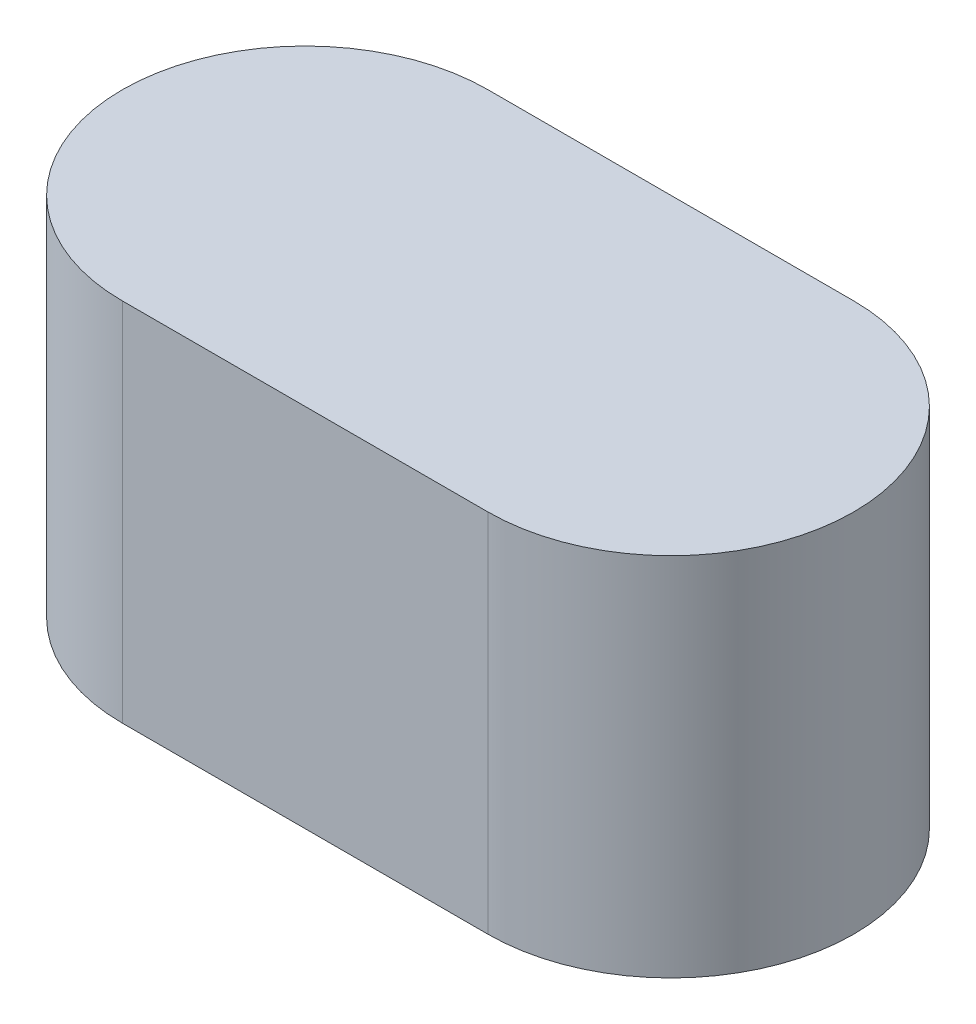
ISO-10303-21;
HEADER;
FILE_DESCRIPTION(('STEP AP214'),'2;1');
FILE_NAME('part.step','',(''),(''),'','','');
FILE_SCHEMA(('AUTOMOTIVE_DESIGN { 1 0 10303 214 1 1 1 1 }'));
ENDSEC;
DATA;
#1=APPLICATION_CONTEXT('core data for automotive mechanical design processes');
#2=APPLICATION_PROTOCOL_DEFINITION('international standard','automotive_design',2000,#1);
#3=PRODUCT_CONTEXT('',#1,'mechanical');
#4=PRODUCT('Part','Part','',(#3));
#5=PRODUCT_RELATED_PRODUCT_CATEGORY('part','',(#4));
#6=PRODUCT_DEFINITION_FORMATION('','',#4);
#7=PRODUCT_DEFINITION_CONTEXT('part definition',#1,'design');
#8=PRODUCT_DEFINITION('design','',#6,#7);
#9=PRODUCT_DEFINITION_SHAPE('','',#8);
#10=(LENGTH_UNIT() NAMED_UNIT(*) SI_UNIT(.MILLI.,.METRE.));
#11=(NAMED_UNIT(*) PLANE_ANGLE_UNIT() SI_UNIT($,.RADIAN.));
#12=(NAMED_UNIT(*) SI_UNIT($,.STERADIAN.) SOLID_ANGLE_UNIT());
#13=UNCERTAINTY_MEASURE_WITH_UNIT(LENGTH_MEASURE(1.E-05),#10,'distance_accuracy_value','');
#14=(GEOMETRIC_REPRESENTATION_CONTEXT(3) GLOBAL_UNCERTAINTY_ASSIGNED_CONTEXT((#13)) GLOBAL_UNIT_ASSIGNED_CONTEXT((#10,
#11,#12)) REPRESENTATION_CONTEXT('',''));
#15=CARTESIAN_POINT('',(0.,0.,0.));
#16=DIRECTION('',(0.,0.,1.));
#17=DIRECTION('',(1.,0.,0.));
#18=AXIS2_PLACEMENT_3D('',#15,#16,#17);
#19=CARTESIAN_POINT('',(-2.5,2.5,0.));
#20=DIRECTION('',(0.,-1.,0.));
#21=DIRECTION('',(0.,0.,-1.));
#22=AXIS2_PLACEMENT_3D('',#19,#20,#21);
#23=CYLINDRICAL_SURFACE('',#22,2.5);
#24=DIRECTION('',(0.,-1.,0.));
#25=VECTOR('',#24,1.);
#26=CARTESIAN_POINT('',(-2.5,2.5,-2.5));
#27=LINE('',#26,#25);
#28=CARTESIAN_POINT('',(-2.5,2.5,-2.5));
#29=VERTEX_POINT('',#28);
#30=CARTESIAN_POINT('',(-2.5,-2.5,-2.5));
#31=VERTEX_POINT('',#30);
#32=EDGE_CURVE('E93',#29,#31,#27,.T.);
#33=ORIENTED_EDGE('',*,*,#32,.T.);
#34=CARTESIAN_POINT('',(-2.5,-2.5,0.));
#35=DIRECTION('',(0.,1.,0.));
#36=DIRECTION('',(0.,0.,1.));
#37=AXIS2_PLACEMENT_3D('',#34,#35,#36);
#38=CIRCLE('',#37,2.5);
#39=CARTESIAN_POINT('',(-2.5,-2.5,2.5));
#40=VERTEX_POINT('',#39);
#41=EDGE_CURVE('E88',#31,#40,#38,.T.);
#42=ORIENTED_EDGE('',*,*,#41,.T.);
#43=DIRECTION('',(0.,-1.,0.));
#44=VECTOR('',#43,1.);
#45=CARTESIAN_POINT('',(-2.5,2.5,2.5));
#46=LINE('',#45,#44);
#47=CARTESIAN_POINT('',(-2.5,2.5,2.5));
#48=VERTEX_POINT('',#47);
#49=EDGE_CURVE('E11',#48,#40,#46,.T.);
#50=ORIENTED_EDGE('',*,*,#49,.F.);
#51=CARTESIAN_POINT('',(-2.5,2.5,0.));
#52=DIRECTION('',(0.,1.,0.));
#53=DIRECTION('',(0.,0.,1.));
#54=AXIS2_PLACEMENT_3D('',#51,#52,#53);
#55=CIRCLE('',#54,2.5);
#56=EDGE_CURVE('E99',#29,#48,#55,.T.);
#57=ORIENTED_EDGE('',*,*,#56,.F.);
#58=EDGE_LOOP('',(#33,#42,#50,#57));
#59=FACE_BOUND('',#58,.T.);
#60=ADVANCED_FACE('F36',(#59),#23,.T.);
#61=CARTESIAN_POINT('',(-2.5,2.5,2.5));
#62=DIRECTION('',(0.,0.,-1.));
#63=DIRECTION('',(-1.,0.,0.));
#64=AXIS2_PLACEMENT_3D('',#61,#62,#63);
#65=PLANE('',#64);
#66=ORIENTED_EDGE('',*,*,#49,.T.);
#67=DIRECTION('',(1.,0.,0.));
#68=VECTOR('',#67,1.);
#69=CARTESIAN_POINT('',(-2.5,-2.5,2.5));
#70=LINE('',#69,#68);
#71=CARTESIAN_POINT('',(2.5,-2.5,2.5));
#72=VERTEX_POINT('',#71);
#73=EDGE_CURVE('E78',#40,#72,#70,.T.);
#74=ORIENTED_EDGE('',*,*,#73,.T.);
#75=DIRECTION('',(0.,-1.,0.));
#76=VECTOR('',#75,1.);
#77=CARTESIAN_POINT('',(2.5,2.5,2.5));
#78=LINE('',#77,#76);
#79=CARTESIAN_POINT('',(2.5,2.5,2.5));
#80=VERTEX_POINT('',#79);
#81=EDGE_CURVE('E43',#80,#72,#78,.T.);
#82=ORIENTED_EDGE('',*,*,#81,.F.);
#83=DIRECTION('',(1.,0.,0.));
#84=VECTOR('',#83,1.);
#85=CARTESIAN_POINT('',(-2.5,2.5,2.5));
#86=LINE('',#85,#84);
#87=EDGE_CURVE('E79',#48,#80,#86,.T.);
#88=ORIENTED_EDGE('',*,*,#87,.F.);
#89=EDGE_LOOP('',(#66,#74,#82,#88));
#90=FACE_BOUND('',#89,.T.);
#91=ADVANCED_FACE('F76',(#90),#65,.F.);
#92=CARTESIAN_POINT('',(2.5,2.5,0.));
#93=DIRECTION('',(0.,-1.,0.));
#94=DIRECTION('',(0.,0.,-1.));
#95=AXIS2_PLACEMENT_3D('',#92,#93,#94);
#96=CYLINDRICAL_SURFACE('',#95,2.5);
#97=ORIENTED_EDGE('',*,*,#81,.T.);
#98=CARTESIAN_POINT('',(2.5,-2.5,0.));
#99=DIRECTION('',(0.,1.,0.));
#100=DIRECTION('',(0.,0.,-1.));
#101=AXIS2_PLACEMENT_3D('',#98,#99,#100);
#102=CIRCLE('',#101,2.5);
#103=CARTESIAN_POINT('',(2.5,-2.5,-2.5));
#104=VERTEX_POINT('',#103);
#105=EDGE_CURVE('E91',#72,#104,#102,.T.);
#106=ORIENTED_EDGE('',*,*,#105,.T.);
#107=DIRECTION('',(0.,-1.,0.));
#108=VECTOR('',#107,1.);
#109=CARTESIAN_POINT('',(2.5,2.5,-2.5));
#110=LINE('',#109,#108);
#111=CARTESIAN_POINT('',(2.5,2.5,-2.5));
#112=VERTEX_POINT('',#111);
#113=EDGE_CURVE('E105',#112,#104,#110,.T.);
#114=ORIENTED_EDGE('',*,*,#113,.F.);
#115=CARTESIAN_POINT('',(2.5,2.5,0.));
#116=DIRECTION('',(0.,1.,0.));
#117=DIRECTION('',(0.,0.,-1.));
#118=AXIS2_PLACEMENT_3D('',#115,#116,#117);
#119=CIRCLE('',#118,2.5);
#120=EDGE_CURVE('E55',#80,#112,#119,.T.);
#121=ORIENTED_EDGE('',*,*,#120,.F.);
#122=EDGE_LOOP('',(#97,#106,#114,#121));
#123=FACE_BOUND('',#122,.T.);
#124=ADVANCED_FACE('F107',(#123),#96,.T.);
#125=CARTESIAN_POINT('',(-2.5,2.5,-2.5));
#126=DIRECTION('',(0.,0.,1.));
#127=DIRECTION('',(1.,0.,0.));
#128=AXIS2_PLACEMENT_3D('',#125,#126,#127);
#129=PLANE('',#128);
#130=ORIENTED_EDGE('',*,*,#113,.T.);
#131=DIRECTION('',(-1.,0.,0.));
#132=VECTOR('',#131,1.);
#133=CARTESIAN_POINT('',(-2.5,-2.5,-2.5));
#134=LINE('',#133,#132);
#135=EDGE_CURVE('E97',#104,#31,#134,.T.);
#136=ORIENTED_EDGE('',*,*,#135,.T.);
#137=ORIENTED_EDGE('',*,*,#32,.F.);
#138=DIRECTION('',(-1.,0.,0.));
#139=VECTOR('',#138,1.);
#140=CARTESIAN_POINT('',(-2.5,2.5,-2.5));
#141=LINE('',#140,#139);
#142=EDGE_CURVE('E50',#112,#29,#141,.T.);
#143=ORIENTED_EDGE('',*,*,#142,.F.);
#144=EDGE_LOOP('',(#130,#136,#137,#143));
#145=FACE_BOUND('',#144,.T.);
#146=ADVANCED_FACE('F109',(#145),#129,.F.);
#147=CARTESIAN_POINT('',(-2.5,2.5,0.));
#148=DIRECTION('',(0.,1.,0.));
#149=DIRECTION('',(0.,0.,1.));
#150=AXIS2_PLACEMENT_3D('',#147,#148,#149);
#151=PLANE('',#150);
#152=ORIENTED_EDGE('',*,*,#56,.T.);
#153=ORIENTED_EDGE('',*,*,#87,.T.);
#154=ORIENTED_EDGE('',*,*,#120,.T.);
#155=ORIENTED_EDGE('',*,*,#142,.T.);
#156=EDGE_LOOP('',(#152,#153,#154,#155));
#157=FACE_BOUND('',#156,.T.);
#158=ADVANCED_FACE('F110',(#157),#151,.T.);
#159=CARTESIAN_POINT('',(-2.5,-2.5,0.));
#160=DIRECTION('',(0.,1.,0.));
#161=DIRECTION('',(0.,0.,1.));
#162=AXIS2_PLACEMENT_3D('',#159,#160,#161);
#163=PLANE('',#162);
#164=ORIENTED_EDGE('',*,*,#41,.F.);
#165=ORIENTED_EDGE('',*,*,#135,.F.);
#166=ORIENTED_EDGE('',*,*,#105,.F.);
#167=ORIENTED_EDGE('',*,*,#73,.F.);
#168=EDGE_LOOP('',(#164,#165,#166,#167));
#169=FACE_BOUND('',#168,.T.);
#170=ADVANCED_FACE('F86',(#169),#163,.F.);
#171=CLOSED_SHELL('',(#60,#91,#124,#146,#158,#170));
#172=MANIFOLD_SOLID_BREP('B2',#171);
#173=ADVANCED_BREP_SHAPE_REPRESENTATION('',(#18,#172),#14);
#174=SHAPE_DEFINITION_REPRESENTATION(#9,#173);
ENDSEC;
END-ISO-10303-21;
